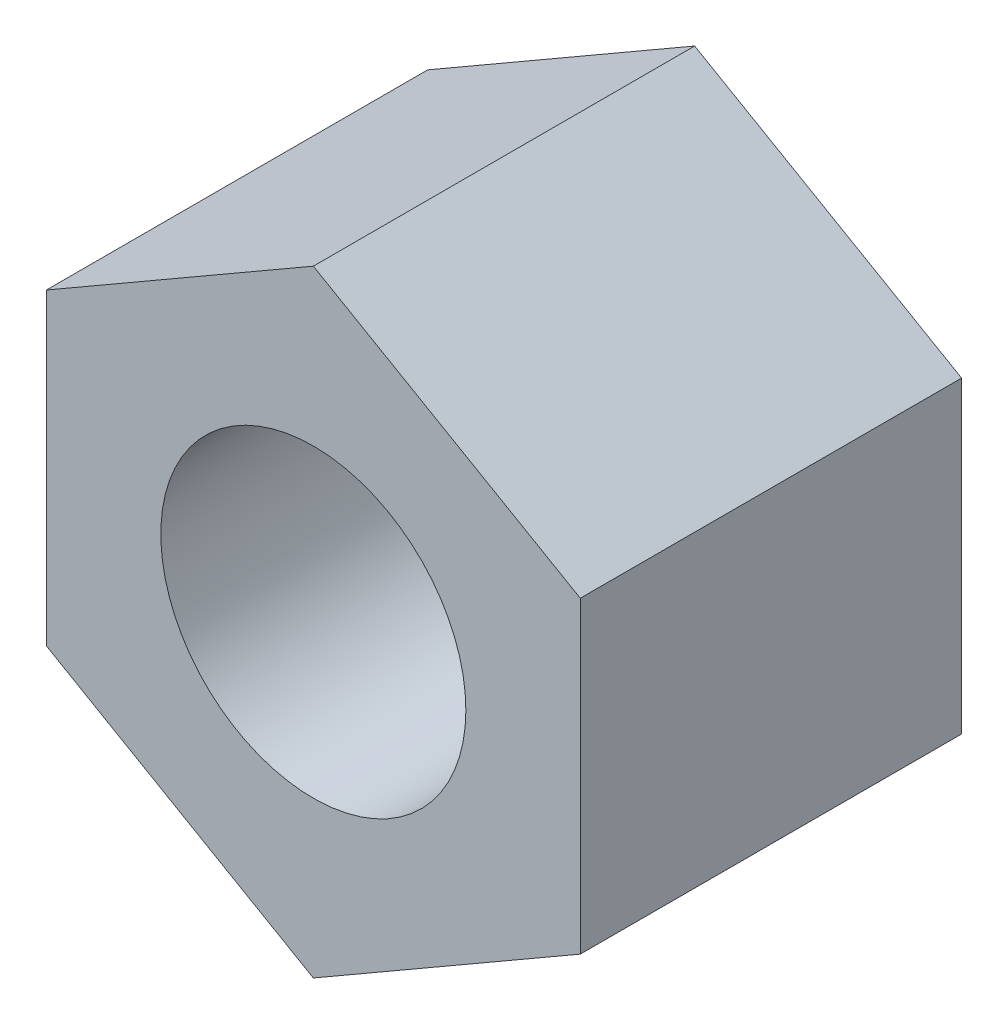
from build123d import *

# Parameters (mm, degrees)
SKETCH_1_R                   = 2
UNTHREADED_NOMINAL_NUT_DEPTH = 5


with BuildPart() as part:
    # Sketch 1 → Unthreaded_nominal_nut (new body)
    with BuildSketch(Plane.XY):
        Polygon((3.5, 2.020725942), (0, 4.041451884), (-3.5, 2.020725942), (-3.5, -2.020725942), (0, -4.041451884), (3.5, -2.020725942), align=None)
        Circle(SKETCH_1_R, mode=Mode.SUBTRACT)
    extrude(amount=UNTHREADED_NOMINAL_NUT_DEPTH)


solid = part.part
